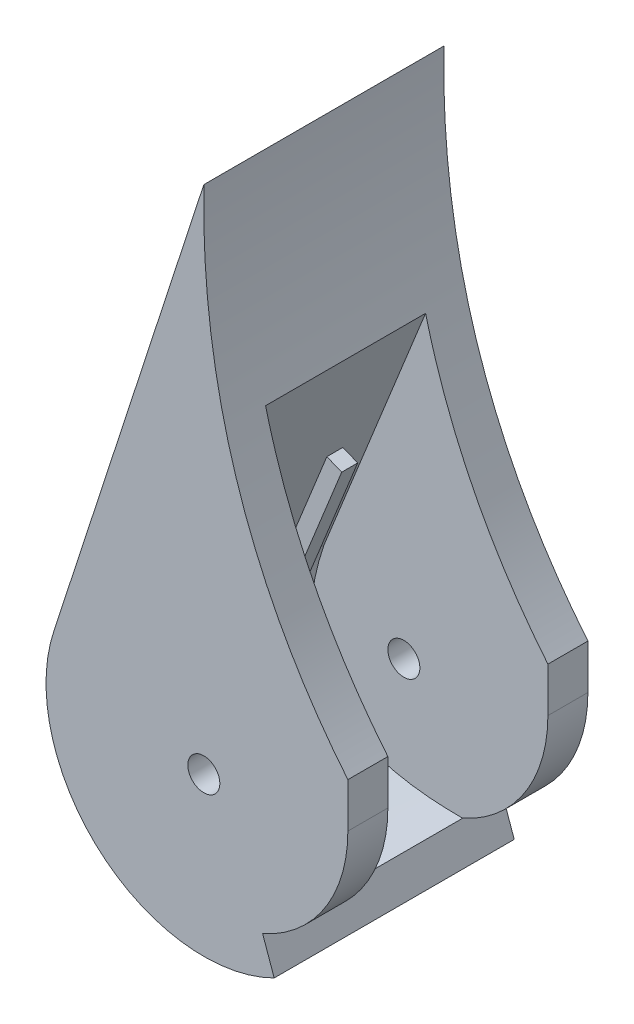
ISO-10303-21;
HEADER;
FILE_DESCRIPTION(('STEP AP214'),'2;1');
FILE_NAME('part.step','',(''),(''),'','','');
FILE_SCHEMA(('AUTOMOTIVE_DESIGN { 1 0 10303 214 1 1 1 1 }'));
ENDSEC;
DATA;
#1=APPLICATION_CONTEXT('core data for automotive mechanical design processes');
#2=APPLICATION_PROTOCOL_DEFINITION('international standard','automotive_design',2000,#1);
#3=PRODUCT_CONTEXT('',#1,'mechanical');
#4=PRODUCT('Part','Part','',(#3));
#5=PRODUCT_RELATED_PRODUCT_CATEGORY('part','',(#4));
#6=PRODUCT_DEFINITION_FORMATION('','',#4);
#7=PRODUCT_DEFINITION_CONTEXT('part definition',#1,'design');
#8=PRODUCT_DEFINITION('design','',#6,#7);
#9=PRODUCT_DEFINITION_SHAPE('','',#8);
#10=(LENGTH_UNIT() NAMED_UNIT(*) SI_UNIT(.MILLI.,.METRE.));
#11=(NAMED_UNIT(*) PLANE_ANGLE_UNIT() SI_UNIT($,.RADIAN.));
#12=(NAMED_UNIT(*) SI_UNIT($,.STERADIAN.) SOLID_ANGLE_UNIT());
#13=UNCERTAINTY_MEASURE_WITH_UNIT(LENGTH_MEASURE(1.E-05),#10,'distance_accuracy_value','');
#14=(GEOMETRIC_REPRESENTATION_CONTEXT(3) GLOBAL_UNCERTAINTY_ASSIGNED_CONTEXT((#13)) GLOBAL_UNIT_ASSIGNED_CONTEXT((#10,
#11,#12)) REPRESENTATION_CONTEXT('',''));
#15=CARTESIAN_POINT('',(0.,0.,0.));
#16=DIRECTION('',(0.,0.,1.));
#17=DIRECTION('',(1.,0.,0.));
#18=AXIS2_PLACEMENT_3D('',#15,#16,#17);
#19=CARTESIAN_POINT('',(-9.97501285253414,-11.1036682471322,7.5));
#20=DIRECTION('',(-1.,0.,0.));
#21=DIRECTION('',(0.,-1.,0.));
#22=AXIS2_PLACEMENT_3D('',#19,#20,#21);
#23=PLANE('',#22);
#24=DIRECTION('',(0.,1.,0.));
#25=VECTOR('',#24,1.);
#26=CARTESIAN_POINT('',(-9.97501285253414,-11.1036682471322,7.5));
#27=LINE('',#26,#25);
#28=CARTESIAN_POINT('',(-9.97501285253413,-2.88783197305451,7.5));
#29=VERTEX_POINT('',#28);
#30=CARTESIAN_POINT('',(-9.97501285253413,-0.103668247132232,7.5));
#31=VERTEX_POINT('',#30);
#32=EDGE_CURVE('E294',#29,#31,#27,.T.);
#33=ORIENTED_EDGE('',*,*,#32,.F.);
#34=DIRECTION('',(0.,0.,1.));
#35=VECTOR('',#34,1.);
#36=CARTESIAN_POINT('',(-9.97501285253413,-2.88783197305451,7.5));
#37=LINE('',#36,#35);
#38=CARTESIAN_POINT('',(-9.97501285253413,-2.88783197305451,5.));
#39=VERTEX_POINT('',#38);
#40=EDGE_CURVE('E356',#29,#39,#37,.F.);
#41=ORIENTED_EDGE('',*,*,#40,.T.);
#42=DIRECTION('',(0.,-1.,0.));
#43=VECTOR('',#42,1.);
#44=CARTESIAN_POINT('',(-9.97501285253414,-11.1036682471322,5.));
#45=LINE('',#44,#43);
#46=CARTESIAN_POINT('',(-9.97501285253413,-0.103668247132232,5.));
#47=VERTEX_POINT('',#46);
#48=EDGE_CURVE('E346',#47,#39,#45,.T.);
#49=ORIENTED_EDGE('',*,*,#48,.F.);
#50=DIRECTION('',(0.,0.,-1.));
#51=VECTOR('',#50,1.);
#52=CARTESIAN_POINT('',(-9.97501285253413,-0.103668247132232,7.5));
#53=LINE('',#52,#51);
#54=EDGE_CURVE('E326',#31,#47,#53,.T.);
#55=ORIENTED_EDGE('',*,*,#54,.F.);
#56=EDGE_LOOP('',(#33,#41,#49,#55));
#57=FACE_BOUND('',#56,.T.);
#58=ADVANCED_FACE('F36',(#57),#23,.F.);
#59=CARTESIAN_POINT('',(-18.9750128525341,-4.3136274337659,7.5));
#60=DIRECTION('',(0.,0.,-1.));
#61=DIRECTION('',(-1.,0.,0.));
#62=AXIS2_PLACEMENT_3D('',#59,#60,#61);
#63=CYLINDRICAL_SURFACE('',#62,1.);
#64=CARTESIAN_POINT('',(-18.9750128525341,-4.3136274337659,7.5));
#65=DIRECTION('',(0.,0.,1.));
#66=DIRECTION('',(1.,0.,0.));
#67=AXIS2_PLACEMENT_3D('',#64,#65,#66);
#68=CIRCLE('',#67,1.);
#69=CARTESIAN_POINT('',(-17.9750128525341,-4.3136274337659,7.5));
#70=VERTEX_POINT('',#69);
#71=EDGE_CURVE('E305',#70,#70,#68,.T.);
#72=ORIENTED_EDGE('',*,*,#71,.T.);
#73=EDGE_LOOP('',(#72));
#74=FACE_BOUND('',#73,.T.);
#75=CARTESIAN_POINT('',(-18.9750128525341,-4.3136274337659,5.));
#76=DIRECTION('',(0.,0.,-1.));
#77=DIRECTION('',(-1.,0.,0.));
#78=AXIS2_PLACEMENT_3D('',#75,#76,#77);
#79=CIRCLE('',#78,1.);
#80=CARTESIAN_POINT('',(-19.9750128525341,-4.3136274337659,5.));
#81=VERTEX_POINT('',#80);
#82=EDGE_CURVE('E337',#81,#81,#79,.T.);
#83=ORIENTED_EDGE('',*,*,#82,.T.);
#84=EDGE_LOOP('',(#83));
#85=FACE_BOUND('',#84,.T.);
#86=ADVANCED_FACE('F267',(#74,#85),#63,.F.);
#87=CARTESIAN_POINT('',(-18.9750128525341,-4.3136274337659,7.5));
#88=DIRECTION('',(0.,0.,1.));
#89=DIRECTION('',(1.,0.,0.));
#90=AXIS2_PLACEMENT_3D('',#87,#88,#89);
#91=PLANE('',#90);
#92=DIRECTION('',(-0.33432370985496,0.942458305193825,0.));
#93=VECTOR('',#92,1.);
#94=CARTESIAN_POINT('',(-15.3007735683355,-11.1036682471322,7.5));
#95=LINE('',#94,#93);
#96=CARTESIAN_POINT('',(-14.5784765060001,-13.1398231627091,7.5));
#97=VERTEX_POINT('',#96);
#98=CARTESIAN_POINT('',(-15.3007735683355,-11.1036682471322,7.5));
#99=VERTEX_POINT('',#98);
#100=EDGE_CURVE('E381',#97,#99,#95,.T.);
#101=ORIENTED_EDGE('',*,*,#100,.T.);
#102=CARTESIAN_POINT('',(-18.9750128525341,-2.88783197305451,7.5));
#103=DIRECTION('',(0.,0.,1.));
#104=DIRECTION('',(1.,0.,0.));
#105=AXIS2_PLACEMENT_3D('',#102,#103,#104);
#106=CIRCLE('',#105,9.);
#107=EDGE_CURVE('E11',#99,#29,#106,.T.);
#108=ORIENTED_EDGE('',*,*,#107,.T.);
#109=ORIENTED_EDGE('',*,*,#32,.T.);
#110=CARTESIAN_POINT('',(-9.97501285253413,-0.103668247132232,7.5));
#111=CARTESIAN_POINT('',(-19.2872292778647,11.2607730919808,7.5));
#112=CARTESIAN_POINT('',(-18.9750128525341,27.5984266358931,7.5));
#113=B_SPLINE_CURVE_WITH_KNOTS('',2,(#110,#111,#112),.UNSPECIFIED.,.F.,.F.,(3,3),(0.,1.),.UNSPECIFIED.);
#114=CARTESIAN_POINT('',(-18.9750128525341,27.5984266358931,7.5));
#115=VERTEX_POINT('',#114);
#116=EDGE_CURVE('E287',#31,#115,#113,.T.);
#117=ORIENTED_EDGE('',*,*,#116,.T.);
#118=DIRECTION('',(-0.308987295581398,-0.951066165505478,0.));
#119=VECTOR('',#118,1.);
#120=CARTESIAN_POINT('',(-18.9750128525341,27.5984266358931,7.5));
#121=LINE('',#120,#119);
#122=CARTESIAN_POINT('',(-28.334921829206,-1.2114722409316,7.5));
#123=VERTEX_POINT('',#122);
#124=EDGE_CURVE('E293',#115,#123,#121,.T.);
#125=ORIENTED_EDGE('',*,*,#124,.T.);
#126=CARTESIAN_POINT('',(-18.9750128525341,-4.3136274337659,7.5));
#127=DIRECTION('',(0.,0.,1.));
#128=DIRECTION('',(1.,0.,0.));
#129=AXIS2_PLACEMENT_3D('',#126,#127,#128);
#130=CIRCLE('',#129,9.86059140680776);
#131=EDGE_CURVE('E319',#123,#97,#130,.T.);
#132=ORIENTED_EDGE('',*,*,#131,.T.);
#133=EDGE_LOOP('',(#101,#108,#109,#117,#125,#132));
#134=FACE_BOUND('',#133,.T.);
#135=ORIENTED_EDGE('',*,*,#71,.F.);
#136=EDGE_LOOP('',(#135));
#137=FACE_BOUND('',#136,.T.);
#138=ADVANCED_FACE('F268',(#134,#137),#91,.T.);
#139=CARTESIAN_POINT('',(-18.9750128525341,-4.3136274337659,-7.5));
#140=DIRECTION('',(0.,0.,1.));
#141=DIRECTION('',(1.,0.,0.));
#142=AXIS2_PLACEMENT_3D('',#139,#140,#141);
#143=PLANE('',#142);
#144=DIRECTION('',(0.,1.,0.));
#145=VECTOR('',#144,1.);
#146=CARTESIAN_POINT('',(-9.97501285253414,-11.1036682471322,-7.5));
#147=LINE('',#146,#145);
#148=CARTESIAN_POINT('',(-9.97501285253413,-2.88783197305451,-7.5));
#149=VERTEX_POINT('',#148);
#150=CARTESIAN_POINT('',(-9.97501285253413,-0.103668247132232,-7.5));
#151=VERTEX_POINT('',#150);
#152=EDGE_CURVE('E308',#149,#151,#147,.T.);
#153=ORIENTED_EDGE('',*,*,#152,.F.);
#154=CARTESIAN_POINT('',(-18.9750128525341,-2.88783197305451,-7.5));
#155=DIRECTION('',(0.,0.,1.));
#156=DIRECTION('',(1.,0.,0.));
#157=AXIS2_PLACEMENT_3D('',#154,#155,#156);
#158=CIRCLE('',#157,9.);
#159=CARTESIAN_POINT('',(-15.3007735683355,-11.1036682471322,-7.5));
#160=VERTEX_POINT('',#159);
#161=EDGE_CURVE('E352',#149,#160,#158,.F.);
#162=ORIENTED_EDGE('',*,*,#161,.T.);
#163=DIRECTION('',(-0.33432370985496,0.942458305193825,0.));
#164=VECTOR('',#163,1.);
#165=CARTESIAN_POINT('',(-15.3007735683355,-11.1036682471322,-7.5));
#166=LINE('',#165,#164);
#167=CARTESIAN_POINT('',(-14.5784765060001,-13.1398231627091,-7.5));
#168=VERTEX_POINT('',#167);
#169=EDGE_CURVE('E304',#168,#160,#166,.T.);
#170=ORIENTED_EDGE('',*,*,#169,.F.);
#171=CARTESIAN_POINT('',(-18.9750128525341,-4.3136274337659,-7.5));
#172=DIRECTION('',(0.,0.,1.));
#173=DIRECTION('',(1.,0.,0.));
#174=AXIS2_PLACEMENT_3D('',#171,#172,#173);
#175=CIRCLE('',#174,9.86059140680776);
#176=CARTESIAN_POINT('',(-28.334921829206,-1.2114722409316,-7.5));
#177=VERTEX_POINT('',#176);
#178=EDGE_CURVE('E301',#177,#168,#175,.T.);
#179=ORIENTED_EDGE('',*,*,#178,.F.);
#180=DIRECTION('',(-0.308987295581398,-0.951066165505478,0.));
#181=VECTOR('',#180,1.);
#182=CARTESIAN_POINT('',(-18.9750128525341,27.5984266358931,-7.5));
#183=LINE('',#182,#181);
#184=CARTESIAN_POINT('',(-18.9750128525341,27.5984266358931,-7.5));
#185=VERTEX_POINT('',#184);
#186=EDGE_CURVE('E314',#185,#177,#183,.T.);
#187=ORIENTED_EDGE('',*,*,#186,.F.);
#188=CARTESIAN_POINT('',(-9.97501285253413,-0.103668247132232,-7.5));
#189=CARTESIAN_POINT('',(-19.2872292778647,11.2607730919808,-7.5));
#190=CARTESIAN_POINT('',(-18.9750128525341,27.5984266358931,-7.5));
#191=B_SPLINE_CURVE_WITH_KNOTS('',2,(#188,#189,#190),.UNSPECIFIED.,.F.,.F.,(3,3),(0.,1.),.UNSPECIFIED.);
#192=EDGE_CURVE('E310',#151,#185,#191,.T.);
#193=ORIENTED_EDGE('',*,*,#192,.F.);
#194=EDGE_LOOP('',(#153,#162,#170,#179,#187,#193));
#195=FACE_BOUND('',#194,.T.);
#196=CARTESIAN_POINT('',(-18.9750128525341,-4.3136274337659,-7.5));
#197=DIRECTION('',(0.,0.,1.));
#198=DIRECTION('',(1.,0.,0.));
#199=AXIS2_PLACEMENT_3D('',#196,#197,#198);
#200=CIRCLE('',#199,1.);
#201=CARTESIAN_POINT('',(-17.9750128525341,-4.3136274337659,-7.5));
#202=VERTEX_POINT('',#201);
#203=EDGE_CURVE('E386',#202,#202,#200,.T.);
#204=ORIENTED_EDGE('',*,*,#203,.T.);
#205=EDGE_LOOP('',(#204));
#206=FACE_BOUND('',#205,.T.);
#207=ADVANCED_FACE('F271',(#195,#206),#143,.F.);
#208=CARTESIAN_POINT('',(-18.9750128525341,-4.3136274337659,7.5));
#209=DIRECTION('',(0.,0.,-1.));
#210=DIRECTION('',(-1.,0.,0.));
#211=AXIS2_PLACEMENT_3D('',#208,#209,#210);
#212=CYLINDRICAL_SURFACE('',#211,9.86059140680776);
#213=ORIENTED_EDGE('',*,*,#178,.T.);
#214=DIRECTION('',(0.,0.,-1.));
#215=VECTOR('',#214,1.);
#216=CARTESIAN_POINT('',(-14.5784765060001,-13.1398231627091,7.5));
#217=LINE('',#216,#215);
#218=EDGE_CURVE('E333',#97,#168,#217,.T.);
#219=ORIENTED_EDGE('',*,*,#218,.F.);
#220=ORIENTED_EDGE('',*,*,#131,.F.);
#221=DIRECTION('',(0.,0.,-1.));
#222=VECTOR('',#221,1.);
#223=CARTESIAN_POINT('',(-28.334921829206,-1.2114722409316,7.5));
#224=LINE('',#223,#222);
#225=EDGE_CURVE('E300',#123,#177,#224,.T.);
#226=ORIENTED_EDGE('',*,*,#225,.T.);
#227=EDGE_LOOP('',(#213,#219,#220,#226));
#228=FACE_BOUND('',#227,.T.);
#229=ADVANCED_FACE('F275',(#228),#212,.T.);
#230=CARTESIAN_POINT('',(-15.3007735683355,-11.1036682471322,7.5));
#231=DIRECTION('',(-0.942458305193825,-0.33432370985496,0.));
#232=DIRECTION('',(0.33432370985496,-0.942458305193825,0.));
#233=AXIS2_PLACEMENT_3D('',#230,#231,#232);
#234=PLANE('',#233);
#235=ORIENTED_EDGE('',*,*,#169,.T.);
#236=DIRECTION('',(0.,0.,-1.));
#237=VECTOR('',#236,1.);
#238=CARTESIAN_POINT('',(-15.3007735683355,-11.1036682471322,7.5));
#239=LINE('',#238,#237);
#240=CARTESIAN_POINT('',(-15.3007735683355,-11.1036682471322,-5.));
#241=VERTEX_POINT('',#240);
#242=EDGE_CURVE('E329',#241,#160,#239,.T.);
#243=ORIENTED_EDGE('',*,*,#242,.F.);
#244=DIRECTION('',(0.,0.,1.));
#245=VECTOR('',#244,1.);
#246=CARTESIAN_POINT('',(-15.3007735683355,-11.1036682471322,-5.));
#247=LINE('',#246,#245);
#248=CARTESIAN_POINT('',(-15.3007735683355,-11.1036682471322,5.));
#249=VERTEX_POINT('',#248);
#250=EDGE_CURVE('E341',#241,#249,#247,.T.);
#251=ORIENTED_EDGE('',*,*,#250,.T.);
#252=EDGE_CURVE('E330',#99,#249,#239,.T.);
#253=ORIENTED_EDGE('',*,*,#252,.F.);
#254=ORIENTED_EDGE('',*,*,#100,.F.);
#255=ORIENTED_EDGE('',*,*,#218,.T.);
#256=EDGE_LOOP('',(#235,#243,#251,#253,#254,#255));
#257=FACE_BOUND('',#256,.T.);
#258=ADVANCED_FACE('F372',(#257),#234,.F.);
#259=DIRECTION('',(0.,-1.,0.));
#260=VECTOR('',#259,1.);
#261=CARTESIAN_POINT('',(-9.97501285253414,-11.1036682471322,-5.));
#262=LINE('',#261,#260);
#263=CARTESIAN_POINT('',(-9.97501285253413,-0.103668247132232,-5.));
#264=VERTEX_POINT('',#263);
#265=CARTESIAN_POINT('',(-9.97501285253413,-2.88783197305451,-5.));
#266=VERTEX_POINT('',#265);
#267=EDGE_CURVE('E389',#264,#266,#262,.T.);
#268=ORIENTED_EDGE('',*,*,#267,.T.);
#269=DIRECTION('',(0.,0.,1.));
#270=VECTOR('',#269,1.);
#271=CARTESIAN_POINT('',(-9.97501285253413,-2.88783197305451,7.5));
#272=LINE('',#271,#270);
#273=EDGE_CURVE('E349',#266,#149,#272,.F.);
#274=ORIENTED_EDGE('',*,*,#273,.T.);
#275=ORIENTED_EDGE('',*,*,#152,.T.);
#276=EDGE_CURVE('E325',#264,#151,#53,.T.);
#277=ORIENTED_EDGE('',*,*,#276,.F.);
#278=EDGE_LOOP('',(#268,#274,#275,#277));
#279=FACE_BOUND('',#278,.T.);
#280=ADVANCED_FACE('F284',(#279),#23,.F.);
#281=DIRECTION('',(0.,0.,-1.));
#282=VECTOR('',#281,1.);
#283=SURFACE_OF_LINEAR_EXTRUSION('',#113,#282);
#284=DIRECTION('',(0.,0.,-1.));
#285=VECTOR('',#284,1.);
#286=CARTESIAN_POINT('',(-17.6188258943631,15.0598560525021,7.5));
#287=LINE('',#286,#285);
#288=CARTESIAN_POINT('',(-17.6188258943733,15.0598560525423,5.));
#289=VERTEX_POINT('',#288);
#290=CARTESIAN_POINT('',(-17.6188258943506,15.0598560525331,-5.));
#291=VERTEX_POINT('',#290);
#292=EDGE_CURVE('E336',#289,#291,#287,.T.);
#293=ORIENTED_EDGE('',*,*,#292,.T.);
#294=CARTESIAN_POINT('',(-9.97501285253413,-0.103668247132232,-5.));
#295=CARTESIAN_POINT('',(-19.2872292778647,11.2607730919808,-5.));
#296=CARTESIAN_POINT('',(-18.9750128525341,27.5984266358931,-5.));
#297=B_SPLINE_CURVE_WITH_KNOTS('',2,(#294,#295,#296),.UNSPECIFIED.,.F.,.F.,(3,3),(0.,1.),.UNSPECIFIED.);
#298=EDGE_CURVE('E345',#291,#264,#297,.F.);
#299=ORIENTED_EDGE('',*,*,#298,.T.);
#300=ORIENTED_EDGE('',*,*,#276,.T.);
#301=ORIENTED_EDGE('',*,*,#192,.T.);
#302=DIRECTION('',(0.,0.,-1.));
#303=VECTOR('',#302,1.);
#304=CARTESIAN_POINT('',(-18.9750128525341,27.5984266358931,7.5));
#305=LINE('',#304,#303);
#306=EDGE_CURVE('E322',#115,#185,#305,.T.);
#307=ORIENTED_EDGE('',*,*,#306,.F.);
#308=ORIENTED_EDGE('',*,*,#116,.F.);
#309=ORIENTED_EDGE('',*,*,#54,.T.);
#310=CARTESIAN_POINT('',(-9.97501285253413,-0.103668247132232,5.));
#311=CARTESIAN_POINT('',(-19.2872292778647,11.2607730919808,5.));
#312=CARTESIAN_POINT('',(-18.9750128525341,27.5984266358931,5.));
#313=B_SPLINE_CURVE_WITH_KNOTS('',2,(#310,#311,#312),.UNSPECIFIED.,.F.,.F.,(3,3),(0.,1.),.UNSPECIFIED.);
#314=EDGE_CURVE('E340',#289,#47,#313,.F.);
#315=ORIENTED_EDGE('',*,*,#314,.F.);
#316=EDGE_LOOP('',(#293,#299,#300,#301,#307,#308,#309,#315));
#317=FACE_BOUND('',#316,.T.);
#318=ADVANCED_FACE('F279',(#317),#283,.F.);
#319=CARTESIAN_POINT('',(-18.9750128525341,27.5984266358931,7.5));
#320=DIRECTION('',(0.951066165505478,-0.308987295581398,0.));
#321=DIRECTION('',(0.308987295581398,0.951066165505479,0.));
#322=AXIS2_PLACEMENT_3D('',#319,#320,#321);
#323=PLANE('',#322);
#324=ORIENTED_EDGE('',*,*,#186,.T.);
#325=ORIENTED_EDGE('',*,*,#225,.F.);
#326=ORIENTED_EDGE('',*,*,#124,.F.);
#327=ORIENTED_EDGE('',*,*,#306,.T.);
#328=EDGE_LOOP('',(#324,#325,#326,#327));
#329=FACE_BOUND('',#328,.T.);
#330=ADVANCED_FACE('F265',(#329),#323,.F.);
#331=CARTESIAN_POINT('',(-18.9750128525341,-4.3136274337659,-5.));
#332=DIRECTION('',(0.,0.,-1.));
#333=DIRECTION('',(-1.,0.,0.));
#334=AXIS2_PLACEMENT_3D('',#331,#332,#333);
#335=CIRCLE('',#334,1.);
#336=CARTESIAN_POINT('',(-19.9750128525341,-4.3136274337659,-5.));
#337=VERTEX_POINT('',#336);
#338=EDGE_CURVE('E342',#337,#337,#335,.T.);
#339=ORIENTED_EDGE('',*,*,#338,.F.);
#340=EDGE_LOOP('',(#339));
#341=FACE_BOUND('',#340,.T.);
#342=ORIENTED_EDGE('',*,*,#203,.F.);
#343=EDGE_LOOP('',(#342));
#344=FACE_BOUND('',#343,.T.);
#345=ADVANCED_FACE('F262',(#341,#344),#63,.F.);
#346=CARTESIAN_POINT('',(-8.73857505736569,37.0392481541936,-5.));
#347=DIRECTION('',(-0.927183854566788,0.37460659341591,0.));
#348=DIRECTION('',(-0.37460659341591,-0.927183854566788,0.));
#349=AXIS2_PLACEMENT_3D('',#346,#347,#348);
#350=PLANE('',#349);
#351=DIRECTION('',(-0.37460659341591,-0.927183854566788,0.));
#352=VECTOR('',#351,1.);
#353=CARTESIAN_POINT('',(-20.3771018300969,8.23288354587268,-2.));
#354=LINE('',#353,#352);
#355=CARTESIAN_POINT('',(-20.7866187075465,7.21929370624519,-2.));
#356=VERTEX_POINT('',#355);
#357=CARTESIAN_POINT('',(-23.7834714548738,-0.198177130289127,-2.));
#358=VERTEX_POINT('',#357);
#359=EDGE_CURVE('E51',#356,#358,#354,.T.);
#360=ORIENTED_EDGE('',*,*,#359,.F.);
#361=DIRECTION('',(0.,0.,-1.));
#362=VECTOR('',#361,1.);
#363=CARTESIAN_POINT('',(-20.7866187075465,7.21929370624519,0.));
#364=LINE('',#363,#362);
#365=CARTESIAN_POINT('',(-20.7866187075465,7.21929370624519,-3.));
#366=VERTEX_POINT('',#365);
#367=EDGE_CURVE('E170',#356,#366,#364,.T.);
#368=ORIENTED_EDGE('',*,*,#367,.T.);
#369=DIRECTION('',(0.37460659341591,0.927183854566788,0.));
#370=VECTOR('',#369,1.);
#371=CARTESIAN_POINT('',(-20.3771018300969,8.23288354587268,-3.));
#372=LINE('',#371,#370);
#373=CARTESIAN_POINT('',(-23.7834714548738,-0.198177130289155,-3.));
#374=VERTEX_POINT('',#373);
#375=EDGE_CURVE('E187',#374,#366,#372,.T.);
#376=ORIENTED_EDGE('',*,*,#375,.F.);
#377=DIRECTION('',(0.,0.,-1.));
#378=VECTOR('',#377,1.);
#379=CARTESIAN_POINT('',(-23.7834714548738,-0.198177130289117,0.));
#380=LINE('',#379,#378);
#381=EDGE_CURVE('E56',#358,#374,#380,.T.);
#382=ORIENTED_EDGE('',*,*,#381,.F.);
#383=EDGE_LOOP('',(#360,#368,#376,#382));
#384=FACE_BOUND('',#383,.T.);
#385=DIRECTION('',(0.,0.,-1.));
#386=VECTOR('',#385,1.);
#387=CARTESIAN_POINT('',(-20.7866187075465,7.21929370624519,0.));
#388=LINE('',#387,#386);
#389=CARTESIAN_POINT('',(-20.7866187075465,7.21929370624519,3.));
#390=VERTEX_POINT('',#389);
#391=CARTESIAN_POINT('',(-20.7866187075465,7.21929370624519,2.));
#392=VERTEX_POINT('',#391);
#393=EDGE_CURVE('E217',#390,#392,#388,.T.);
#394=ORIENTED_EDGE('',*,*,#393,.T.);
#395=DIRECTION('',(-0.37460659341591,-0.927183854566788,0.));
#396=VECTOR('',#395,1.);
#397=CARTESIAN_POINT('',(-20.3771018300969,8.23288354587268,2.));
#398=LINE('',#397,#396);
#399=CARTESIAN_POINT('',(-23.7834714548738,-0.198177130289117,2.));
#400=VERTEX_POINT('',#399);
#401=EDGE_CURVE('E172',#392,#400,#398,.T.);
#402=ORIENTED_EDGE('',*,*,#401,.T.);
#403=DIRECTION('',(0.,0.,-1.));
#404=VECTOR('',#403,1.);
#405=CARTESIAN_POINT('',(-23.7834714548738,-0.198177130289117,0.));
#406=LINE('',#405,#404);
#407=CARTESIAN_POINT('',(-23.7834714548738,-0.198177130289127,3.));
#408=VERTEX_POINT('',#407);
#409=EDGE_CURVE('E207',#408,#400,#406,.T.);
#410=ORIENTED_EDGE('',*,*,#409,.F.);
#411=DIRECTION('',(0.37460659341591,0.927183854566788,0.));
#412=VECTOR('',#411,1.);
#413=CARTESIAN_POINT('',(-20.3771018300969,8.23288354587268,3.));
#414=LINE('',#413,#412);
#415=EDGE_CURVE('E219',#408,#390,#414,.T.);
#416=ORIENTED_EDGE('',*,*,#415,.T.);
#417=EDGE_LOOP('',(#394,#402,#410,#416));
#418=FACE_BOUND('',#417,.T.);
#419=DIRECTION('',(-0.37460659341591,-0.927183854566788,0.));
#420=VECTOR('',#419,1.);
#421=CARTESIAN_POINT('',(-8.73857505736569,37.0392481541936,5.));
#422=LINE('',#421,#420);
#423=CARTESIAN_POINT('',(-23.9707747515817,-0.661769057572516,5.));
#424=VERTEX_POINT('',#423);
#425=EDGE_CURVE('E234',#289,#424,#422,.T.);
#426=ORIENTED_EDGE('',*,*,#425,.T.);
#427=DIRECTION('',(0.,0.,1.));
#428=VECTOR('',#427,1.);
#429=CARTESIAN_POINT('',(-23.9707747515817,-0.661769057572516,-5.));
#430=LINE('',#429,#428);
#431=CARTESIAN_POINT('',(-23.9707747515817,-0.661769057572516,-5.));
#432=VERTEX_POINT('',#431);
#433=EDGE_CURVE('E244',#432,#424,#430,.T.);
#434=ORIENTED_EDGE('',*,*,#433,.F.);
#435=DIRECTION('',(-0.37460659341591,-0.927183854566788,0.));
#436=VECTOR('',#435,1.);
#437=CARTESIAN_POINT('',(-8.73857505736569,37.0392481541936,-5.));
#438=LINE('',#437,#436);
#439=EDGE_CURVE('E235',#291,#432,#438,.T.);
#440=ORIENTED_EDGE('',*,*,#439,.F.);
#441=ORIENTED_EDGE('',*,*,#292,.F.);
#442=EDGE_LOOP('',(#426,#434,#440,#441));
#443=FACE_BOUND('',#442,.T.);
#444=ADVANCED_FACE('F258',(#384,#418,#443),#350,.F.);
#445=CARTESIAN_POINT('',(-23.5682828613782,-8.51857346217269,-5.));
#446=DIRECTION('',(0.,0.,-1.));
#447=DIRECTION('',(-1.,0.,0.));
#448=AXIS2_PLACEMENT_3D('',#445,#446,#447);
#449=PLANE('',#448);
#450=ORIENTED_EDGE('',*,*,#338,.T.);
#451=EDGE_LOOP('',(#450));
#452=FACE_BOUND('',#451,.T.);
#453=CARTESIAN_POINT('',(-23.9707747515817,-0.661769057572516,-5.));
#454=CARTESIAN_POINT('',(-27.5007915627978,-11.154428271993,-5.));
#455=CARTESIAN_POINT('',(-15.3007735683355,-11.1036682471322,-5.));
#456=B_SPLINE_CURVE_WITH_KNOTS('',2,(#453,#454,#455),.UNSPECIFIED.,.F.,.F.,(3,3),(0.,1.),.UNSPECIFIED.);
#457=EDGE_CURVE('E237',#432,#241,#456,.T.);
#458=ORIENTED_EDGE('',*,*,#457,.T.);
#459=CARTESIAN_POINT('',(-18.9750128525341,-2.88783197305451,-5.));
#460=DIRECTION('',(0.,0.,-1.));
#461=DIRECTION('',(-1.,0.,0.));
#462=AXIS2_PLACEMENT_3D('',#459,#460,#461);
#463=CIRCLE('',#462,9.);
#464=EDGE_CURVE('E354',#241,#266,#463,.F.);
#465=ORIENTED_EDGE('',*,*,#464,.T.);
#466=ORIENTED_EDGE('',*,*,#267,.F.);
#467=ORIENTED_EDGE('',*,*,#298,.F.);
#468=ORIENTED_EDGE('',*,*,#439,.T.);
#469=EDGE_LOOP('',(#458,#465,#466,#467,#468));
#470=FACE_BOUND('',#469,.T.);
#471=ADVANCED_FACE('F261',(#452,#470),#449,.F.);
#472=CARTESIAN_POINT('',(-23.5682828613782,-8.51857346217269,5.));
#473=DIRECTION('',(0.,0.,-1.));
#474=DIRECTION('',(-1.,0.,0.));
#475=AXIS2_PLACEMENT_3D('',#472,#473,#474);
#476=PLANE('',#475);
#477=ORIENTED_EDGE('',*,*,#82,.F.);
#478=EDGE_LOOP('',(#477));
#479=FACE_BOUND('',#478,.T.);
#480=ORIENTED_EDGE('',*,*,#48,.T.);
#481=CARTESIAN_POINT('',(-18.9750128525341,-2.88783197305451,5.));
#482=DIRECTION('',(0.,0.,-1.));
#483=DIRECTION('',(-1.,0.,0.));
#484=AXIS2_PLACEMENT_3D('',#481,#482,#483);
#485=CIRCLE('',#484,9.);
#486=EDGE_CURVE('E44',#39,#249,#485,.T.);
#487=ORIENTED_EDGE('',*,*,#486,.T.);
#488=CARTESIAN_POINT('',(-23.9707747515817,-0.661769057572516,5.));
#489=CARTESIAN_POINT('',(-27.5007915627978,-11.154428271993,5.));
#490=CARTESIAN_POINT('',(-15.3007735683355,-11.1036682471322,5.));
#491=B_SPLINE_CURVE_WITH_KNOTS('',2,(#488,#489,#490),.UNSPECIFIED.,.F.,.F.,(3,3),(0.,1.),.UNSPECIFIED.);
#492=EDGE_CURVE('E238',#424,#249,#491,.T.);
#493=ORIENTED_EDGE('',*,*,#492,.F.);
#494=ORIENTED_EDGE('',*,*,#425,.F.);
#495=ORIENTED_EDGE('',*,*,#314,.T.);
#496=EDGE_LOOP('',(#480,#487,#493,#494,#495));
#497=FACE_BOUND('',#496,.T.);
#498=ADVANCED_FACE('F255',(#479,#497),#476,.T.);
#499=DIRECTION('',(0.,0.,1.));
#500=VECTOR('',#499,1.);
#501=SURFACE_OF_LINEAR_EXTRUSION('',#456,#500);
#502=ORIENTED_EDGE('',*,*,#492,.T.);
#503=ORIENTED_EDGE('',*,*,#250,.F.);
#504=ORIENTED_EDGE('',*,*,#457,.F.);
#505=ORIENTED_EDGE('',*,*,#433,.T.);
#506=EDGE_LOOP('',(#502,#503,#504,#505));
#507=FACE_BOUND('',#506,.T.);
#508=ADVANCED_FACE('F250',(#507),#501,.F.);
#509=CARTESIAN_POINT('',(-18.9750128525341,-2.88783197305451,7.5));
#510=DIRECTION('',(0.,0.,1.));
#511=DIRECTION('',(1.,0.,0.));
#512=AXIS2_PLACEMENT_3D('',#509,#510,#511);
#513=CYLINDRICAL_SURFACE('',#512,9.);
#514=ORIENTED_EDGE('',*,*,#464,.F.);
#515=ORIENTED_EDGE('',*,*,#242,.T.);
#516=ORIENTED_EDGE('',*,*,#161,.F.);
#517=ORIENTED_EDGE('',*,*,#273,.F.);
#518=EDGE_LOOP('',(#514,#515,#516,#517));
#519=FACE_BOUND('',#518,.T.);
#520=ADVANCED_FACE('F254',(#519),#513,.T.);
#521=CARTESIAN_POINT('',(-18.9750128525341,-2.88783197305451,7.5));
#522=DIRECTION('',(0.,0.,1.));
#523=DIRECTION('',(1.,0.,0.));
#524=AXIS2_PLACEMENT_3D('',#521,#522,#523);
#525=CYLINDRICAL_SURFACE('',#524,9.);
#526=ORIENTED_EDGE('',*,*,#107,.F.);
#527=ORIENTED_EDGE('',*,*,#252,.T.);
#528=ORIENTED_EDGE('',*,*,#486,.F.);
#529=ORIENTED_EDGE('',*,*,#40,.F.);
#530=EDGE_LOOP('',(#526,#527,#528,#529));
#531=FACE_BOUND('',#530,.T.);
#532=ADVANCED_FACE('F38',(#531),#525,.T.);
#533=CARTESIAN_POINT('',(-19.4499179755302,7.85827695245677,2.));
#534=DIRECTION('',(0.,0.,-1.));
#535=DIRECTION('',(0.,1.,0.));
#536=AXIS2_PLACEMENT_3D('',#533,#534,#535);
#537=PLANE('',#536);
#538=ORIENTED_EDGE('',*,*,#401,.F.);
#539=DIRECTION('',(-0.927183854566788,0.37460659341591,0.));
#540=VECTOR('',#539,1.);
#541=CARTESIAN_POINT('',(-19.8594348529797,6.84468711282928,2.));
#542=LINE('',#541,#540);
#543=CARTESIAN_POINT('',(-19.8594348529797,6.84468711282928,2.));
#544=VERTEX_POINT('',#543);
#545=EDGE_CURVE('E231',#544,#392,#542,.T.);
#546=ORIENTED_EDGE('',*,*,#545,.F.);
#547=DIRECTION('',(-0.37460659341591,-0.927183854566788,0.));
#548=VECTOR('',#547,1.);
#549=CARTESIAN_POINT('',(-19.4499179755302,7.85827695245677,2.));
#550=LINE('',#549,#548);
#551=CARTESIAN_POINT('',(-22.856287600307,-0.572783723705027,2.));
#552=VERTEX_POINT('',#551);
#553=EDGE_CURVE('E203',#544,#552,#550,.T.);
#554=ORIENTED_EDGE('',*,*,#553,.T.);
#555=DIRECTION('',(-0.927183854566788,0.37460659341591,0.));
#556=VECTOR('',#555,1.);
#557=CARTESIAN_POINT('',(-22.856287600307,-0.572783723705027,2.));
#558=LINE('',#557,#556);
#559=EDGE_CURVE('E215',#552,#400,#558,.T.);
#560=ORIENTED_EDGE('',*,*,#559,.T.);
#561=EDGE_LOOP('',(#538,#546,#554,#560));
#562=FACE_BOUND('',#561,.T.);
#563=ADVANCED_FACE('F459',(#562),#537,.T.);
#564=CARTESIAN_POINT('',(-19.8594348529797,6.84468711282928,0.));
#565=DIRECTION('',(0.37460659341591,0.927183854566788,0.));
#566=DIRECTION('',(-0.927183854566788,0.37460659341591,0.));
#567=AXIS2_PLACEMENT_3D('',#564,#565,#566);
#568=PLANE('',#567);
#569=ORIENTED_EDGE('',*,*,#393,.F.);
#570=DIRECTION('',(-0.927183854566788,0.37460659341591,0.));
#571=VECTOR('',#570,1.);
#572=CARTESIAN_POINT('',(-19.8594348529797,6.84468711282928,3.));
#573=LINE('',#572,#571);
#574=CARTESIAN_POINT('',(-19.8594348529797,6.84468711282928,3.));
#575=VERTEX_POINT('',#574);
#576=EDGE_CURVE('E228',#575,#390,#573,.T.);
#577=ORIENTED_EDGE('',*,*,#576,.F.);
#578=DIRECTION('',(0.,0.,-1.));
#579=VECTOR('',#578,1.);
#580=CARTESIAN_POINT('',(-19.8594348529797,6.84468711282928,0.));
#581=LINE('',#580,#579);
#582=EDGE_CURVE('E206',#575,#544,#581,.T.);
#583=ORIENTED_EDGE('',*,*,#582,.T.);
#584=ORIENTED_EDGE('',*,*,#545,.T.);
#585=EDGE_LOOP('',(#569,#577,#583,#584));
#586=FACE_BOUND('',#585,.T.);
#587=ADVANCED_FACE('F462',(#586),#568,.T.);
#588=CARTESIAN_POINT('',(-19.4499179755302,7.85827695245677,3.));
#589=DIRECTION('',(0.,0.,1.));
#590=DIRECTION('',(0.,-1.,0.));
#591=AXIS2_PLACEMENT_3D('',#588,#589,#590);
#592=PLANE('',#591);
#593=ORIENTED_EDGE('',*,*,#415,.F.);
#594=DIRECTION('',(-0.927183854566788,0.37460659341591,0.));
#595=VECTOR('',#594,1.);
#596=CARTESIAN_POINT('',(-22.856287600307,-0.572783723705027,3.));
#597=LINE('',#596,#595);
#598=CARTESIAN_POINT('',(-22.856287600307,-0.572783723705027,3.));
#599=VERTEX_POINT('',#598);
#600=EDGE_CURVE('E225',#599,#408,#597,.T.);
#601=ORIENTED_EDGE('',*,*,#600,.F.);
#602=DIRECTION('',(0.37460659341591,0.927183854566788,0.));
#603=VECTOR('',#602,1.);
#604=CARTESIAN_POINT('',(-19.4499179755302,7.85827695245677,3.));
#605=LINE('',#604,#603);
#606=EDGE_CURVE('E210',#599,#575,#605,.T.);
#607=ORIENTED_EDGE('',*,*,#606,.T.);
#608=ORIENTED_EDGE('',*,*,#576,.T.);
#609=EDGE_LOOP('',(#593,#601,#607,#608));
#610=FACE_BOUND('',#609,.T.);
#611=ADVANCED_FACE('F466',(#610),#592,.T.);
#612=CARTESIAN_POINT('',(-22.856287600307,-0.572783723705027,0.));
#613=DIRECTION('',(0.37460659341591,0.927183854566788,0.));
#614=DIRECTION('',(-0.927183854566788,0.37460659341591,0.));
#615=AXIS2_PLACEMENT_3D('',#612,#613,#614);
#616=PLANE('',#615);
#617=ORIENTED_EDGE('',*,*,#409,.T.);
#618=ORIENTED_EDGE('',*,*,#559,.F.);
#619=DIRECTION('',(0.,0.,-1.));
#620=VECTOR('',#619,1.);
#621=CARTESIAN_POINT('',(-22.856287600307,-0.572783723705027,0.));
#622=LINE('',#621,#620);
#623=EDGE_CURVE('E213',#599,#552,#622,.T.);
#624=ORIENTED_EDGE('',*,*,#623,.F.);
#625=ORIENTED_EDGE('',*,*,#600,.T.);
#626=EDGE_LOOP('',(#617,#618,#624,#625));
#627=FACE_BOUND('',#626,.T.);
#628=ADVANCED_FACE('F470',(#627),#616,.F.);
#629=CARTESIAN_POINT('',(-19.4499179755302,7.85827695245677,0.));
#630=DIRECTION('',(0.927183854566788,-0.37460659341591,0.));
#631=DIRECTION('',(0.37460659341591,0.927183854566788,0.));
#632=AXIS2_PLACEMENT_3D('',#629,#630,#631);
#633=PLANE('',#632);
#634=ORIENTED_EDGE('',*,*,#553,.F.);
#635=ORIENTED_EDGE('',*,*,#582,.F.);
#636=ORIENTED_EDGE('',*,*,#606,.F.);
#637=ORIENTED_EDGE('',*,*,#623,.T.);
#638=EDGE_LOOP('',(#634,#635,#636,#637));
#639=FACE_BOUND('',#638,.T.);
#640=ADVANCED_FACE('F474',(#639),#633,.T.);
#641=CARTESIAN_POINT('',(-19.8594348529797,6.84468711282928,0.));
#642=DIRECTION('',(0.37460659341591,0.927183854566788,0.));
#643=DIRECTION('',(-0.927183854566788,0.37460659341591,0.));
#644=AXIS2_PLACEMENT_3D('',#641,#642,#643);
#645=PLANE('',#644);
#646=ORIENTED_EDGE('',*,*,#367,.F.);
#647=DIRECTION('',(-0.927183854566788,0.37460659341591,0.));
#648=VECTOR('',#647,1.);
#649=CARTESIAN_POINT('',(-19.8594348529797,6.84468711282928,-2.));
#650=LINE('',#649,#648);
#651=CARTESIAN_POINT('',(-19.8594348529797,6.84468711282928,-2.));
#652=VERTEX_POINT('',#651);
#653=EDGE_CURVE('E164',#652,#356,#650,.T.);
#654=ORIENTED_EDGE('',*,*,#653,.F.);
#655=DIRECTION('',(0.,0.,-1.));
#656=VECTOR('',#655,1.);
#657=CARTESIAN_POINT('',(-19.8594348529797,6.84468711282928,0.));
#658=LINE('',#657,#656);
#659=CARTESIAN_POINT('',(-19.8594348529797,6.84468711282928,-3.));
#660=VERTEX_POINT('',#659);
#661=EDGE_CURVE('E169',#652,#660,#658,.T.);
#662=ORIENTED_EDGE('',*,*,#661,.T.);
#663=DIRECTION('',(-0.927183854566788,0.37460659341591,0.));
#664=VECTOR('',#663,1.);
#665=CARTESIAN_POINT('',(-19.8594348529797,6.84468711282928,-3.));
#666=LINE('',#665,#664);
#667=EDGE_CURVE('E194',#660,#366,#666,.T.);
#668=ORIENTED_EDGE('',*,*,#667,.T.);
#669=EDGE_LOOP('',(#646,#654,#662,#668));
#670=FACE_BOUND('',#669,.T.);
#671=ADVANCED_FACE('F166',(#670),#645,.T.);
#672=CARTESIAN_POINT('',(-19.4499179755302,7.85827695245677,-2.));
#673=DIRECTION('',(0.,0.,-1.));
#674=DIRECTION('',(0.,1.,0.));
#675=AXIS2_PLACEMENT_3D('',#672,#673,#674);
#676=PLANE('',#675);
#677=ORIENTED_EDGE('',*,*,#359,.T.);
#678=DIRECTION('',(-0.927183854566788,0.37460659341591,0.));
#679=VECTOR('',#678,1.);
#680=CARTESIAN_POINT('',(-22.856287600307,-0.572783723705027,-2.));
#681=LINE('',#680,#679);
#682=CARTESIAN_POINT('',(-22.856287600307,-0.572783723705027,-2.));
#683=VERTEX_POINT('',#682);
#684=EDGE_CURVE('E173',#683,#358,#681,.T.);
#685=ORIENTED_EDGE('',*,*,#684,.F.);
#686=DIRECTION('',(-0.37460659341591,-0.927183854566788,0.));
#687=VECTOR('',#686,1.);
#688=CARTESIAN_POINT('',(-19.4499179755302,7.85827695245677,-2.));
#689=LINE('',#688,#687);
#690=EDGE_CURVE('E176',#652,#683,#689,.T.);
#691=ORIENTED_EDGE('',*,*,#690,.F.);
#692=ORIENTED_EDGE('',*,*,#653,.T.);
#693=EDGE_LOOP('',(#677,#685,#691,#692));
#694=FACE_BOUND('',#693,.T.);
#695=ADVANCED_FACE('F177',(#694),#676,.F.);
#696=CARTESIAN_POINT('',(-22.856287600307,-0.572783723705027,0.));
#697=DIRECTION('',(0.37460659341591,0.927183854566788,0.));
#698=DIRECTION('',(-0.927183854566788,0.37460659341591,0.));
#699=AXIS2_PLACEMENT_3D('',#696,#697,#698);
#700=PLANE('',#699);
#701=ORIENTED_EDGE('',*,*,#381,.T.);
#702=DIRECTION('',(-0.927183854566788,0.37460659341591,0.));
#703=VECTOR('',#702,1.);
#704=CARTESIAN_POINT('',(-22.856287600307,-0.572783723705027,-3.));
#705=LINE('',#704,#703);
#706=CARTESIAN_POINT('',(-22.856287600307,-0.572783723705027,-3.));
#707=VERTEX_POINT('',#706);
#708=EDGE_CURVE('E199',#707,#374,#705,.T.);
#709=ORIENTED_EDGE('',*,*,#708,.F.);
#710=DIRECTION('',(0.,0.,-1.));
#711=VECTOR('',#710,1.);
#712=CARTESIAN_POINT('',(-22.856287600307,-0.572783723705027,0.));
#713=LINE('',#712,#711);
#714=EDGE_CURVE('E181',#683,#707,#713,.T.);
#715=ORIENTED_EDGE('',*,*,#714,.F.);
#716=ORIENTED_EDGE('',*,*,#684,.T.);
#717=EDGE_LOOP('',(#701,#709,#715,#716));
#718=FACE_BOUND('',#717,.T.);
#719=ADVANCED_FACE('F483',(#718),#700,.F.);
#720=CARTESIAN_POINT('',(-19.4499179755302,7.85827695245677,-3.));
#721=DIRECTION('',(0.,0.,1.));
#722=DIRECTION('',(0.,-1.,0.));
#723=AXIS2_PLACEMENT_3D('',#720,#721,#722);
#724=PLANE('',#723);
#725=ORIENTED_EDGE('',*,*,#375,.T.);
#726=ORIENTED_EDGE('',*,*,#667,.F.);
#727=DIRECTION('',(0.37460659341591,0.927183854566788,0.));
#728=VECTOR('',#727,1.);
#729=CARTESIAN_POINT('',(-19.4499179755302,7.85827695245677,-3.));
#730=LINE('',#729,#728);
#731=EDGE_CURVE('E185',#707,#660,#730,.T.);
#732=ORIENTED_EDGE('',*,*,#731,.F.);
#733=ORIENTED_EDGE('',*,*,#708,.T.);
#734=EDGE_LOOP('',(#725,#726,#732,#733));
#735=FACE_BOUND('',#734,.T.);
#736=ADVANCED_FACE('F486',(#735),#724,.F.);
#737=CARTESIAN_POINT('',(-19.4499179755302,7.85827695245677,0.));
#738=DIRECTION('',(0.927183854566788,-0.37460659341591,0.));
#739=DIRECTION('',(0.37460659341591,0.927183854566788,0.));
#740=AXIS2_PLACEMENT_3D('',#737,#738,#739);
#741=PLANE('',#740);
#742=ORIENTED_EDGE('',*,*,#661,.F.);
#743=ORIENTED_EDGE('',*,*,#690,.T.);
#744=ORIENTED_EDGE('',*,*,#714,.T.);
#745=ORIENTED_EDGE('',*,*,#731,.T.);
#746=EDGE_LOOP('',(#742,#743,#744,#745));
#747=FACE_BOUND('',#746,.T.);
#748=ADVANCED_FACE('F183',(#747),#741,.T.);
#749=CLOSED_SHELL('',(#58,#86,#138,#207,#229,#258,#280,#318,#330,#345,#444,#471,#498,#508,#520,
#532,#563,#587,#611,#628,#640,#671,#695,#719,#736,#748));
#750=MANIFOLD_SOLID_BREP('B2',#749);
#751=ADVANCED_BREP_SHAPE_REPRESENTATION('',(#18,#750),#14);
#752=SHAPE_DEFINITION_REPRESENTATION(#9,#751);
ENDSEC;
END-ISO-10303-21;
